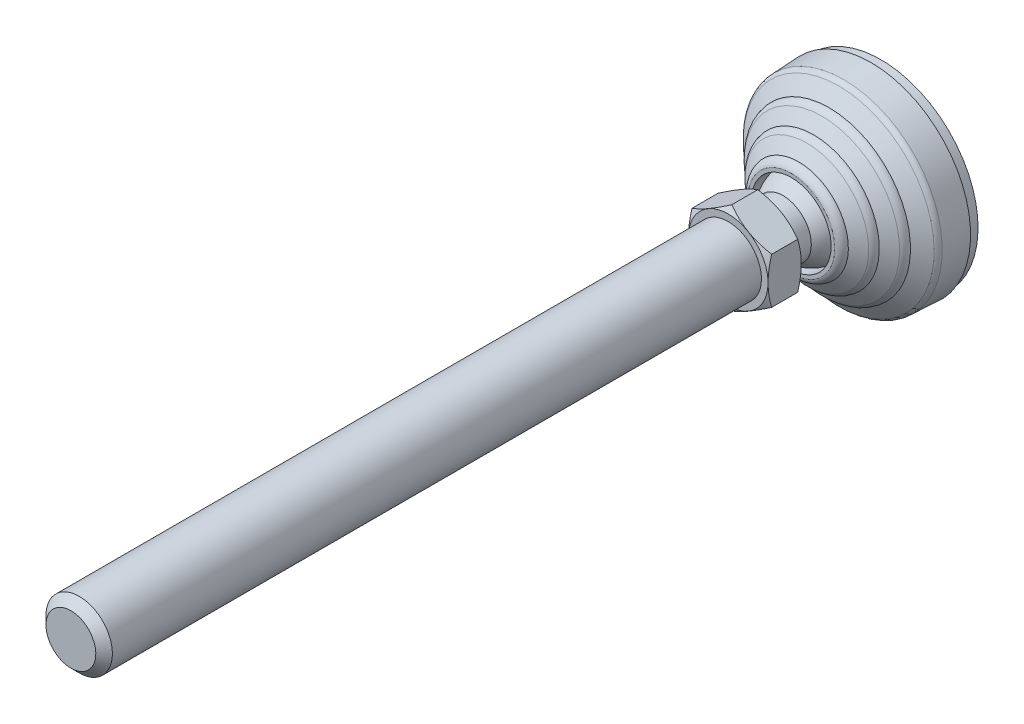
ISO-10303-21;
HEADER;
FILE_DESCRIPTION(('STEP AP214'),'2;1');
FILE_NAME('part.step','',(''),(''),'','','');
FILE_SCHEMA(('AUTOMOTIVE_DESIGN { 1 0 10303 214 1 1 1 1 }'));
ENDSEC;
DATA;
#1=APPLICATION_CONTEXT('core data for automotive mechanical design processes');
#2=APPLICATION_PROTOCOL_DEFINITION('international standard','automotive_design',2000,#1);
#3=PRODUCT_CONTEXT('',#1,'mechanical');
#4=PRODUCT('Part','Part','',(#3));
#5=PRODUCT_RELATED_PRODUCT_CATEGORY('part','',(#4));
#6=PRODUCT_DEFINITION_FORMATION('','',#4);
#7=PRODUCT_DEFINITION_CONTEXT('part definition',#1,'design');
#8=PRODUCT_DEFINITION('design','',#6,#7);
#9=PRODUCT_DEFINITION_SHAPE('','',#8);
#10=(LENGTH_UNIT() NAMED_UNIT(*) SI_UNIT(.MILLI.,.METRE.));
#11=(NAMED_UNIT(*) PLANE_ANGLE_UNIT() SI_UNIT($,.RADIAN.));
#12=(NAMED_UNIT(*) SI_UNIT($,.STERADIAN.) SOLID_ANGLE_UNIT());
#13=UNCERTAINTY_MEASURE_WITH_UNIT(LENGTH_MEASURE(1.E-05),#10,'distance_accuracy_value','');
#14=(GEOMETRIC_REPRESENTATION_CONTEXT(3) GLOBAL_UNCERTAINTY_ASSIGNED_CONTEXT((#13)) GLOBAL_UNIT_ASSIGNED_CONTEXT((#10,
#11,#12)) REPRESENTATION_CONTEXT('',''));
#15=CARTESIAN_POINT('',(0.,0.,0.));
#16=DIRECTION('',(0.,0.,1.));
#17=DIRECTION('',(1.,0.,0.));
#18=AXIS2_PLACEMENT_3D('',#15,#16,#17);
#19=CARTESIAN_POINT('',(0.,0.,93.4665));
#20=DIRECTION('',(0.,0.,-1.));
#21=DIRECTION('',(0.,1.,0.));
#22=AXIS2_PLACEMENT_3D('',#19,#20,#21);
#23=CYLINDRICAL_SURFACE('',#22,10.);
#24=CARTESIAN_POINT('',(0.,0.,241.5));
#25=DIRECTION('',(0.,0.,1.));
#26=DIRECTION('',(0.,-1.,0.));
#27=AXIS2_PLACEMENT_3D('',#24,#25,#26);
#28=CIRCLE('',#27,10.);
#29=CARTESIAN_POINT('',(0.,-10.,241.5));
#30=VERTEX_POINT('',#29);
#31=EDGE_CURVE('E9',#30,#30,#28,.F.);
#32=ORIENTED_EDGE('',*,*,#31,.T.);
#33=EDGE_LOOP('',(#32));
#34=FACE_BOUND('',#33,.T.);
#35=CARTESIAN_POINT('',(0.,0.,46.));
#36=DIRECTION('',(0.,0.,-1.));
#37=DIRECTION('',(0.,1.,0.));
#38=AXIS2_PLACEMENT_3D('',#35,#36,#37);
#39=CIRCLE('',#38,10.);
#40=CARTESIAN_POINT('',(0.,10.,46.));
#41=VERTEX_POINT('',#40);
#42=EDGE_CURVE('E124',#41,#41,#39,.F.);
#43=ORIENTED_EDGE('',*,*,#42,.T.);
#44=EDGE_LOOP('',(#43));
#45=FACE_BOUND('',#44,.T.);
#46=ADVANCED_FACE('F14',(#34,#45),#23,.T.);
#47=CARTESIAN_POINT('',(10.995,0.,46.));
#48=DIRECTION('',(0.,0.,1.));
#49=DIRECTION('',(0.,-1.,0.));
#50=AXIS2_PLACEMENT_3D('',#47,#48,#49);
#51=PLANE('',#50);
#52=CARTESIAN_POINT('',(0.,0.,46.));
#53=DIRECTION('',(0.,0.,-1.));
#54=DIRECTION('',(0.,1.,0.));
#55=AXIS2_PLACEMENT_3D('',#52,#53,#54);
#56=CIRCLE('',#55,11.99);
#57=CARTESIAN_POINT('',(0.,11.99,46.));
#58=VERTEX_POINT('',#57);
#59=EDGE_CURVE('E132',#58,#58,#56,.F.);
#60=ORIENTED_EDGE('',*,*,#59,.T.);
#61=EDGE_LOOP('',(#60));
#62=FACE_BOUND('',#61,.T.);
#63=ORIENTED_EDGE('',*,*,#42,.F.);
#64=EDGE_LOOP('',(#63));
#65=FACE_BOUND('',#64,.T.);
#66=ADVANCED_FACE('F157',(#62,#65),#51,.T.);
#67=CARTESIAN_POINT('',(0.,0.,44.9159643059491));
#68=DIRECTION('',(0.,0.,-1.));
#69=DIRECTION('',(0.,1.,0.));
#70=AXIS2_PLACEMENT_3D('',#67,#68,#69);
#71=CONICAL_SURFACE('',#70,13.8676048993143,1.0471975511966);
#72=ORIENTED_EDGE('',*,*,#59,.F.);
#73=EDGE_LOOP('',(#72));
#74=FACE_BOUND('',#73,.T.);
#75=CARTESIAN_POINT('',(-2.88482840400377E-08,-13.8564064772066,44.9224297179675));
#76=CARTESIAN_POINT('',(0.263784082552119,-13.7041106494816,45.010340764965));
#77=CARTESIAN_POINT('',(0.528551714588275,-13.5512469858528,45.0942615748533));
#78=CARTESIAN_POINT('',(1.06021019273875,-13.2442938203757,45.2530155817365));
#79=CARTESIAN_POINT('',(1.32710170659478,-13.0902039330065,45.3278457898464));
#80=CARTESIAN_POINT('',(2.13207647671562,-12.6254515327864,45.537252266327));
#81=CARTESIAN_POINT('',(2.67333741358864,-12.3129543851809,45.6563603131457));
#82=CARTESIAN_POINT('',(3.48330954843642,-11.8453167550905,45.796023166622));
#83=CARTESIAN_POINT('',(3.74960108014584,-11.6915732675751,45.8358073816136));
#84=CARTESIAN_POINT('',(4.28341699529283,-11.3833745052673,45.9025217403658));
#85=CARTESIAN_POINT('',(4.55094140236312,-11.2289192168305,45.9294516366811));
#86=CARTESIAN_POINT('',(5.08643614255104,-10.9197511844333,45.9697675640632));
#87=CARTESIAN_POINT('',(5.35440556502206,-10.7650389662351,45.9831696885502));
#88=CARTESIAN_POINT('',(5.8905925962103,-10.4554712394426,45.996144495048));
#89=CARTESIAN_POINT('',(6.15881019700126,-10.3006157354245,45.9957176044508));
#90=CARTESIAN_POINT('',(6.66023029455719,-10.0111207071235,45.9820002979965));
#91=CARTESIAN_POINT('',(6.89346857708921,-9.87646052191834,45.97038309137));
#92=CARTESIAN_POINT('',(7.35940867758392,-9.60744987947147,45.9369099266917));
#93=CARTESIAN_POINT('',(7.59211045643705,-9.47309944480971,45.9150532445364));
#94=CARTESIAN_POINT('',(8.05685109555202,-9.20478131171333,45.8614821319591));
#95=CARTESIAN_POINT('',(8.28888924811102,-9.07081402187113,45.8297595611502));
#96=CARTESIAN_POINT('',(8.75187776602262,-8.80350747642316,45.7570131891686));
#97=CARTESIAN_POINT('',(8.98282805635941,-8.67016826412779,45.7159887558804));
#98=CARTESIAN_POINT('',(9.68388987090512,-8.26541003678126,45.5779256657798));
#99=CARTESIAN_POINT('',(10.1519713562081,-7.99516306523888,45.4671213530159));
#100=CARTESIAN_POINT('',(11.081155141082,-7.45869855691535,45.2156417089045));
#101=CARTESIAN_POINT('',(11.5422693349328,-7.19247415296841,45.075025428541));
#102=CARTESIAN_POINT('',(11.9999999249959,-6.92820327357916,44.922429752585));
#103=B_SPLINE_CURVE_WITH_KNOTS('',3,(#75,#76,#77,#78,#79,#80,#81,#82,#83,#84,#85,#86,#87,#88,
#89,#90,#91,#92,#93,#94,#95,#96,#97,#98,#99,#100,#101,#102),.UNSPECIFIED.,.F.,.F.,(4,2,2,2,2,2,
2,2,2,2,2,2,2,4),(0.,0.950996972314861,1.90230578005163,3.80897261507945,4.73890631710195,
5.6688579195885,6.59770188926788,7.52651715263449,8.33503482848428,9.14360968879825,
9.95285348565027,10.7621522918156,12.4163368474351,14.0672749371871),.UNSPECIFIED.);
#104=CARTESIAN_POINT('',(-1.44241383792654E-08,-13.8564064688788,44.9224297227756));
#105=VERTEX_POINT('',#104);
#106=CARTESIAN_POINT('',(12.,-6.92820324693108,44.9224297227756));
#107=VERTEX_POINT('',#106);
#108=EDGE_CURVE('E143',#105,#107,#103,.T.);
#109=ORIENTED_EDGE('',*,*,#108,.T.);
#110=CARTESIAN_POINT('',(12.,-6.92820326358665,44.9224297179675));
#111=CARTESIAN_POINT('',(12.,-6.64374493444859,45.0045333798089));
#112=CARTESIAN_POINT('',(12.,-6.35829458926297,45.0831531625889));
#113=CARTESIAN_POINT('',(12.,-5.78524260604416,45.2325348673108));
#114=CARTESIAN_POINT('',(12.,-5.49764024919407,45.3032940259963));
#115=CARTESIAN_POINT('',(12.,-4.63053083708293,45.5026195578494));
#116=CARTESIAN_POINT('',(12.,-4.04782834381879,45.6179071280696));
#117=CARTESIAN_POINT('',(12.,-3.17548925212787,45.7575170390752));
#118=CARTESIAN_POINT('',(12.,-2.88840964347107,45.7982045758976));
#119=CARTESIAN_POINT('',(12.,-2.31290718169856,45.8685767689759));
#120=CARTESIAN_POINT('',(12.,-2.02448443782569,45.8982623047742));
#121=CARTESIAN_POINT('',(12.,-1.44696804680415,45.9459902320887));
#122=CARTESIAN_POINT('',(12.,-1.15787537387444,45.9640443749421));
#123=CARTESIAN_POINT('',(12.,-0.579188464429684,45.9881624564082));
#124=CARTESIAN_POINT('',(12.,-0.289594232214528,45.994226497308));
#125=CARTESIAN_POINT('',(12.,0.289594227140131,45.9942264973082));
#126=CARTESIAN_POINT('',(12.,0.579188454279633,45.9881624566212));
#127=CARTESIAN_POINT('',(12.,1.15787535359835,45.9640443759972));
#128=CARTESIAN_POINT('',(12.,1.44696802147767,45.9459902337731));
#129=CARTESIAN_POINT('',(12.,2.02448440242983,45.8982623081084));
#130=CARTESIAN_POINT('',(12.,2.31290714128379,45.8685767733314));
#131=CARTESIAN_POINT('',(12.,2.88840959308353,45.798204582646));
#132=CARTESIAN_POINT('',(12.,3.17548919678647,45.7575170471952));
#133=CARTESIAN_POINT('',(12.,4.04782827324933,45.6179071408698));
#134=CARTESIAN_POINT('',(12.,4.63053075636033,45.5026195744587));
#135=CARTESIAN_POINT('',(12.,5.49764015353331,45.3032940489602));
#136=CARTESIAN_POINT('',(12.,5.78524250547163,45.2325348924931));
#137=CARTESIAN_POINT('',(12.,6.35829447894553,45.0831531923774));
#138=CARTESIAN_POINT('',(12.,6.64374481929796,45.004533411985));
#139=CARTESIAN_POINT('',(12.,6.92820314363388,44.9224297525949));
#140=B_SPLINE_CURVE_WITH_KNOTS('',3,(#110,#111,#112,#113,#114,#115,#116,#117,#118,#119,#120,
#121,#122,#123,#124,#125,#126,#127,#128,#129,#130,#131,#132,#133,#134,#135,#136,#137,#138,#139),
.UNSPECIFIED.,.F.,.F.,(4,2,2,2,2,2,2,2,2,2,2,2,2,2,4),(0.,0.888148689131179,1.77660860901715,
3.55698615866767,4.42666281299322,5.2962699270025,6.16499708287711,7.03371682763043,
7.90243655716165,8.7711636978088,9.64077079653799,10.5104474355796,12.2908249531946,
13.1792848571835,14.0674335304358),.UNSPECIFIED.);
#141=CARTESIAN_POINT('',(12.0000000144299,6.92820322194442,44.9224297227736));
#142=VERTEX_POINT('',#141);
#143=EDGE_CURVE('E135',#107,#142,#140,.T.);
#144=ORIENTED_EDGE('',*,*,#143,.T.);
#145=CARTESIAN_POINT('',(12.0000000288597,6.92820321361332,44.9224297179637));
#146=CARTESIAN_POINT('',(11.7362159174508,7.08049904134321,45.0103407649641));
#147=CARTESIAN_POINT('',(11.4714482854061,7.23336270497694,45.0942615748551));
#148=CARTESIAN_POINT('',(10.9397898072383,7.54031587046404,45.2530155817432));
#149=CARTESIAN_POINT('',(10.6728982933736,7.69440575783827,45.3278457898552));
#150=CARTESIAN_POINT('',(9.86792352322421,8.15915815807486,45.5372522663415));
#151=CARTESIAN_POINT('',(9.32666258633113,8.47165530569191,45.6563603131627));
#152=CARTESIAN_POINT('',(8.51669045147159,8.93929293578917,45.7960231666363));
#153=CARTESIAN_POINT('',(8.25039891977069,9.0930364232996,45.8358073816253));
#154=CARTESIAN_POINT('',(7.71658300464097,9.40123518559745,45.9025217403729));
#155=CARTESIAN_POINT('',(7.44905859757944,9.55569047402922,45.9294516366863));
#156=CARTESIAN_POINT('',(6.91356385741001,9.86485850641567,45.9697675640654));
#157=CARTESIAN_POINT('',(6.64559443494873,10.0195707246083,45.9831696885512));
#158=CARTESIAN_POINT('',(6.10940740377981,10.3291384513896,45.996144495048));
#159=CARTESIAN_POINT('',(5.84118980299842,10.4839939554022,45.9957176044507));
#160=CARTESIAN_POINT('',(5.33976970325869,10.773488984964,45.9820002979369));
#161=CARTESIAN_POINT('',(5.10653141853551,10.9081491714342,45.970383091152));
#162=CARTESIAN_POINT('',(4.64059131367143,11.1771598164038,45.9369099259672));
#163=CARTESIAN_POINT('',(4.4078895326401,11.3115102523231,45.9150532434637));
#164=CARTESIAN_POINT('',(3.94314888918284,11.5798283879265,45.8614821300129));
#165=CARTESIAN_POINT('',(3.71111073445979,11.7137956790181,45.8297595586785));
#166=CARTESIAN_POINT('',(3.24812221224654,11.9811022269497,45.7570131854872));
#167=CARTESIAN_POINT('',(3.01717191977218,12.1144414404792,45.7159887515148));
#168=CARTESIAN_POINT('',(2.31611009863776,12.5191996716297,45.5779256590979));
#169=CARTESIAN_POINT('',(1.84802860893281,12.7894466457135,45.4671213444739));
#170=CARTESIAN_POINT('',(0.918844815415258,13.3259111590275,45.2156416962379));
#171=CARTESIAN_POINT('',(0.457730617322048,13.5921355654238,45.0750254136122));
#172=CARTESIAN_POINT('',(2.30778996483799E-08,13.856406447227,44.9224297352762));
#173=B_SPLINE_CURVE_WITH_KNOTS('',3,(#145,#146,#147,#148,#149,#150,#151,#152,#153,#154,#155,
#156,#157,#158,#159,#160,#161,#162,#163,#164,#165,#166,#167,#168,#169,#170,#171,#172),
.UNSPECIFIED.,.F.,.F.,(4,2,2,2,2,2,2,2,2,2,2,2,2,4),(0.,0.95099697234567,1.9023057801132,
3.8089726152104,4.73890631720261,5.66885791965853,6.59770188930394,7.52651715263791,
8.33503483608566,9.14360970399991,9.95285350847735,10.7621523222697,12.4163368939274,
14.0672749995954),.UNSPECIFIED.);
#174=CARTESIAN_POINT('',(-1.15389591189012E-08,13.856406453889,44.92242973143));
#175=VERTEX_POINT('',#174);
#176=EDGE_CURVE('E180',#142,#175,#173,.T.);
#177=ORIENTED_EDGE('',*,*,#176,.T.);
#178=CARTESIAN_POINT('',(-2.30779115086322E-08,13.856406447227,44.9224297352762));
#179=CARTESIAN_POINT('',(-0.263784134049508,13.7041106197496,45.0103407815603));
#180=CARTESIAN_POINT('',(-0.528551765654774,13.5512469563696,45.0942615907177));
#181=CARTESIAN_POINT('',(-1.06021024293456,13.2442937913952,45.2530155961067));
#182=CARTESIAN_POINT('',(-1.32710175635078,13.0902039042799,45.3278458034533));
#183=CARTESIAN_POINT('',(-2.13207652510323,12.6254515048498,45.5372522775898));
#184=CARTESIAN_POINT('',(-2.67333746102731,12.3129543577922,45.656360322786));
#185=CARTESIAN_POINT('',(-3.48330959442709,11.8453167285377,45.7960231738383));
#186=CARTESIAN_POINT('',(-3.74960112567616,11.6915732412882,45.8358073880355));
#187=CARTESIAN_POINT('',(-4.28341703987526,11.3833744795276,45.9025217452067));
#188=CARTESIAN_POINT('',(-4.55094144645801,11.2289191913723,45.9294516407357));
#189=CARTESIAN_POINT('',(-5.08643618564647,10.9197511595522,45.9697675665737));
#190=CARTESIAN_POINT('',(-5.35440560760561,10.7650389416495,45.9831696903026));
#191=CARTESIAN_POINT('',(-5.89059263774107,10.4554712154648,45.9961444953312));
#192=CARTESIAN_POINT('',(-6.15881023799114,10.300615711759,45.9957176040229));
#193=CARTESIAN_POINT('',(-6.66023033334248,10.0111206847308,45.9820002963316));
#194=CARTESIAN_POINT('',(-6.89346861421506,9.87646050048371,45.9703830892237));
#195=CARTESIAN_POINT('',(-7.35940871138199,9.60744985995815,45.9369099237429));
#196=CARTESIAN_POINT('',(-7.59211048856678,9.47309942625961,45.9150532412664));
#197=CARTESIAN_POINT('',(-8.05685112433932,9.20478129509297,45.8614821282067));
#198=CARTESIAN_POINT('',(-8.28888927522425,9.0708140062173,45.8297595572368));
#199=CARTESIAN_POINT('',(-8.75187778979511,8.80350746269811,45.7570131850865));
#200=CARTESIAN_POINT('',(-8.98282807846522,8.67016825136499,45.7159887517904));
#201=CARTESIAN_POINT('',(-9.68388988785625,8.26541002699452,45.5779256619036));
#202=CARTESIAN_POINT('',(-10.1519713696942,7.9951630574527,45.4671213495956));
#203=CARTESIAN_POINT('',(-11.0811551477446,7.45869855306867,45.2156417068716));
#204=CARTESIAN_POINT('',(-11.5422693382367,7.19247415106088,45.0750254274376));
#205=CARTESIAN_POINT('',(-11.9999999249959,6.92820327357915,44.922429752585));
#206=B_SPLINE_CURVE_WITH_KNOTS('',3,(#178,#179,#180,#181,#182,#183,#184,#185,#186,#187,#188,
#189,#190,#191,#192,#193,#194,#195,#196,#197,#198,#199,#200,#201,#202,#203,#204,#205),
.UNSPECIFIED.,.F.,.F.,(4,2,2,2,2,2,2,2,2,2,2,2,2,4),(0.,0.9509969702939,1.90230577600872,
3.80897260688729,4.73890630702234,5.6688579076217,6.5977018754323,7.52651713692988,
8.33503480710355,9.14360966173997,9.95285345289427,10.7621522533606,12.4163367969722,
14.0672748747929),.UNSPECIFIED.);
#207=CARTESIAN_POINT('',(-12.,6.92820324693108,44.9224297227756));
#208=VERTEX_POINT('',#207);
#209=EDGE_CURVE('E172',#175,#208,#206,.T.);
#210=ORIENTED_EDGE('',*,*,#209,.T.);
#211=CARTESIAN_POINT('',(-12.,6.92820326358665,44.9224297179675));
#212=CARTESIAN_POINT('',(-12.,6.64374493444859,45.0045333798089));
#213=CARTESIAN_POINT('',(-12.,6.35829458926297,45.0831531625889));
#214=CARTESIAN_POINT('',(-12.,5.78524260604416,45.2325348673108));
#215=CARTESIAN_POINT('',(-12.,5.49764024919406,45.3032940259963));
#216=CARTESIAN_POINT('',(-12.,4.63053083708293,45.5026195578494));
#217=CARTESIAN_POINT('',(-12.,4.04782834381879,45.6179071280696));
#218=CARTESIAN_POINT('',(-12.,3.17548925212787,45.7575170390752));
#219=CARTESIAN_POINT('',(-12.,2.88840964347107,45.7982045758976));
#220=CARTESIAN_POINT('',(-12.,2.31290718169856,45.8685767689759));
#221=CARTESIAN_POINT('',(-12.,2.02448443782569,45.8982623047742));
#222=CARTESIAN_POINT('',(-12.,1.44696804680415,45.9459902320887));
#223=CARTESIAN_POINT('',(-12.,1.15787537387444,45.9640443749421));
#224=CARTESIAN_POINT('',(-12.,0.579188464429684,45.9881624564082));
#225=CARTESIAN_POINT('',(-12.,0.289594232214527,45.994226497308));
#226=CARTESIAN_POINT('',(-12.,-0.289594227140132,45.9942264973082));
#227=CARTESIAN_POINT('',(-12.,-0.579188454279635,45.9881624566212));
#228=CARTESIAN_POINT('',(-12.,-1.15787535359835,45.9640443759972));
#229=CARTESIAN_POINT('',(-12.,-1.44696802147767,45.9459902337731));
#230=CARTESIAN_POINT('',(-12.,-2.02448440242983,45.8982623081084));
#231=CARTESIAN_POINT('',(-12.,-2.31290714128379,45.8685767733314));
#232=CARTESIAN_POINT('',(-12.,-2.88840959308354,45.798204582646));
#233=CARTESIAN_POINT('',(-12.,-3.17548919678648,45.7575170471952));
#234=CARTESIAN_POINT('',(-12.,-4.04782827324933,45.6179071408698));
#235=CARTESIAN_POINT('',(-12.,-4.63053075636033,45.5026195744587));
#236=CARTESIAN_POINT('',(-12.,-5.49764015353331,45.3032940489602));
#237=CARTESIAN_POINT('',(-12.,-5.78524250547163,45.2325348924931));
#238=CARTESIAN_POINT('',(-12.,-6.35829447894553,45.0831531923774));
#239=CARTESIAN_POINT('',(-12.,-6.64374481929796,45.004533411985));
#240=CARTESIAN_POINT('',(-12.,-6.92820314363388,44.9224297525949));
#241=B_SPLINE_CURVE_WITH_KNOTS('',3,(#211,#212,#213,#214,#215,#216,#217,#218,#219,#220,#221,
#222,#223,#224,#225,#226,#227,#228,#229,#230,#231,#232,#233,#234,#235,#236,#237,#238,#239,#240),
.UNSPECIFIED.,.F.,.F.,(4,2,2,2,2,2,2,2,2,2,2,2,2,2,4),(0.,0.888148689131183,1.77660860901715,
3.55698615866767,4.42666281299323,5.2962699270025,6.16499708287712,7.03371682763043,
7.90243655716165,8.7711636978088,9.640770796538,10.5104474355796,12.2908249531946,
13.1792848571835,14.0674335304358),.UNSPECIFIED.);
#242=CARTESIAN_POINT('',(-12.0000000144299,-6.92820322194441,44.9224297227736));
#243=VERTEX_POINT('',#242);
#244=EDGE_CURVE('E350',#208,#243,#241,.T.);
#245=ORIENTED_EDGE('',*,*,#244,.T.);
#246=CARTESIAN_POINT('',(-12.0000000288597,-6.92820321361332,44.9224297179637));
#247=CARTESIAN_POINT('',(-11.7362159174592,-7.08049904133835,45.0103407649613));
#248=CARTESIAN_POINT('',(-11.471448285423,-7.23336270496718,45.0942615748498));
#249=CARTESIAN_POINT('',(-10.9397898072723,-7.54031587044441,45.2530155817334));
#250=CARTESIAN_POINT('',(-10.6728982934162,-7.69440575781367,45.3278457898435));
#251=CARTESIAN_POINT('',(-9.86792352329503,-8.15915815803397,45.5372522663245));
#252=CARTESIAN_POINT('',(-9.3266625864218,-8.47165530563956,45.6563603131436));
#253=CARTESIAN_POINT('',(-8.5166904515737,-8.93929293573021,45.7960231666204));
#254=CARTESIAN_POINT('',(-8.25039891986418,-9.09303642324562,45.8358073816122));
#255=CARTESIAN_POINT('',(-7.71658300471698,-9.40123518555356,45.9025217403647));
#256=CARTESIAN_POINT('',(-7.44905859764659,-9.55569047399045,45.9294516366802));
#257=CARTESIAN_POINT('',(-6.91356385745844,-9.8648585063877,45.9697675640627));
#258=CARTESIAN_POINT('',(-6.64559443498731,-10.019570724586,45.9831696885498));
#259=CARTESIAN_POINT('',(-6.10940740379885,-10.3291384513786,45.996144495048));
#260=CARTESIAN_POINT('',(-5.84118980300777,-10.4839939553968,45.9957176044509));
#261=CARTESIAN_POINT('',(-5.33976970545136,-10.7734889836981,45.9820002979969));
#262=CARTESIAN_POINT('',(-5.10653142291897,-10.9081491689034,45.9703830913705));
#263=CARTESIAN_POINT('',(-4.64059132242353,-11.1771598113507,45.9369099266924));
#264=CARTESIAN_POINT('',(-4.40788954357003,-11.3115102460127,45.9150532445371));
#265=CARTESIAN_POINT('',(-3.94314890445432,-11.5798283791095,45.8614821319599));
#266=CARTESIAN_POINT('',(-3.71111075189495,-11.7137956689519,45.8297595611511));
#267=CARTESIAN_POINT('',(-3.24812223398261,-11.9811022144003,45.7570131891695));
#268=CARTESIAN_POINT('',(-3.01717194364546,-12.1144414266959,45.7159887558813));
#269=CARTESIAN_POINT('',(-2.3161101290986,-12.5191996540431,45.5779256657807));
#270=CARTESIAN_POINT('',(-1.84802864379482,-12.7894466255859,45.4671213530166));
#271=CARTESIAN_POINT('',(-0.918844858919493,-13.3259111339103,45.215641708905));
#272=CARTESIAN_POINT('',(-0.457730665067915,-13.5921355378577,45.0750254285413));
#273=CARTESIAN_POINT('',(-7.50040961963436E-08,-13.8564064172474,44.922429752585));
#274=B_SPLINE_CURVE_WITH_KNOTS('',3,(#246,#247,#248,#249,#250,#251,#252,#253,#254,#255,#256,
#257,#258,#259,#260,#261,#262,#263,#264,#265,#266,#267,#268,#269,#270,#271,#272,#273),
.UNSPECIFIED.,.F.,.F.,(4,2,2,2,2,2,2,2,2,2,2,2,2,4),(0.,0.950996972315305,1.90230578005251,
3.80897261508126,4.73890631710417,5.66885791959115,6.59770188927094,7.52651715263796,
8.33503482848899,9.14360968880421,9.95285348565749,10.7621522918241,12.4163368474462,
14.0672749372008),.UNSPECIFIED.);
#275=EDGE_CURVE('E162',#243,#105,#274,.T.);
#276=ORIENTED_EDGE('',*,*,#275,.T.);
#277=EDGE_LOOP('',(#109,#144,#177,#210,#245,#276));
#278=FACE_BOUND('',#277,.T.);
#279=ADVANCED_FACE('F152',(#74,#278),#71,.T.);
#280=CARTESIAN_POINT('',(0.,-13.856406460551,46.1));
#281=DIRECTION('',(0.5,0.866025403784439,0.));
#282=DIRECTION('',(-0.866025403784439,0.5,0.));
#283=AXIS2_PLACEMENT_3D('',#280,#281,#282);
#284=PLANE('',#283);
#285=DIRECTION('',(0.,0.,1.));
#286=VECTOR('',#285,1.);
#287=CARTESIAN_POINT('',(0.,-13.856406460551,46.1));
#288=LINE('',#287,#286);
#289=CARTESIAN_POINT('',(0.,-13.856406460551,37.0775702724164));
#290=VERTEX_POINT('',#289);
#291=EDGE_CURVE('E376',#290,#105,#288,.T.);
#292=ORIENTED_EDGE('',*,*,#291,.T.);
#293=ORIENTED_EDGE('',*,*,#275,.F.);
#294=DIRECTION('',(0.,0.,1.));
#295=VECTOR('',#294,1.);
#296=CARTESIAN_POINT('',(-12.,-6.9282032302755,46.1));
#297=LINE('',#296,#295);
#298=CARTESIAN_POINT('',(-12.,-6.9282032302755,37.0775702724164));
#299=VERTEX_POINT('',#298);
#300=EDGE_CURVE('E368',#299,#243,#297,.T.);
#301=ORIENTED_EDGE('',*,*,#300,.F.);
#302=CARTESIAN_POINT('',(0.,-13.856406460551,37.0775702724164));
#303=CARTESIAN_POINT('',(-0.263784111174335,-13.7041106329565,36.9896592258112));
#304=CARTESIAN_POINT('',(-0.528551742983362,-13.5512469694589,36.9057384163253));
#305=CARTESIAN_POINT('',(-1.0602102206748,-13.2442938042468,36.7469844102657));
#306=CARTESIAN_POINT('',(-1.32710173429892,-13.0902039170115,36.6721542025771));
#307=CARTESIAN_POINT('',(-2.13207650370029,-12.6254515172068,36.4627477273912));
#308=CARTESIAN_POINT('',(-2.67333744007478,-12.3129543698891,36.3436396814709));
#309=CARTESIAN_POINT('',(-3.48330957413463,-11.8453167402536,36.2039768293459));
#310=CARTESIAN_POINT('',(-3.74960110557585,-11.6915732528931,36.1641926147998));
#311=CARTESIAN_POINT('',(-4.28341702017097,-11.3833744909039,36.097478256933));
#312=CARTESIAN_POINT('',(-4.55094142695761,-11.2289192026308,36.0705483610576));
#313=CARTESIAN_POINT('',(-5.08643616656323,-10.9197511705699,36.0302324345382));
#314=CARTESIAN_POINT('',(-5.35440558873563,-10.765038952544,36.0168303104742));
#315=CARTESIAN_POINT('',(-5.89059261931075,-10.4554712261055,36.0038555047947));
#316=CARTESIAN_POINT('',(-6.15881021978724,-10.300615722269,36.0042823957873));
#317=CARTESIAN_POINT('',(-6.66023031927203,-10.0111206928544,36.0179997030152));
#318=CARTESIAN_POINT('',(-6.8934686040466,-9.87646050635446,36.029616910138));
#319=CARTESIAN_POINT('',(-7.35940870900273,-9.6074498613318,36.063090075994));
#320=CARTESIAN_POINT('',(-7.59211049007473,-9.47309942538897,36.0849467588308));
#321=CARTESIAN_POINT('',(-8.05685113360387,-9.20478128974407,36.1385178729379));
#322=CARTESIAN_POINT('',(-8.28888928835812,-9.07081399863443,36.1702404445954));
#323=CARTESIAN_POINT('',(-8.75187781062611,-8.8035074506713,36.2429868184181));
#324=CARTESIAN_POINT('',(-8.98282810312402,-8.67016823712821,36.2840112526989));
#325=CARTESIAN_POINT('',(-9.6838899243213,-8.2654100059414,36.4220743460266));
#326=CARTESIAN_POINT('',(-10.1519714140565,-7.99516303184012,36.5328786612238));
#327=CARTESIAN_POINT('',(-11.0811552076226,-7.45869851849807,36.7843583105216));
#328=CARTESIAN_POINT('',(-11.5422694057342,-7.19247411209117,36.924974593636));
#329=CARTESIAN_POINT('',(-12.,-6.9282032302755,37.0775702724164));
#330=B_SPLINE_CURVE_WITH_KNOTS('',3,(#302,#303,#304,#305,#306,#307,#308,#309,#310,#311,#312,
#313,#314,#315,#316,#317,#318,#319,#320,#321,#322,#323,#324,#325,#326,#327,#328,#329),
.UNSPECIFIED.,.F.,.F.,(4,2,2,2,2,2,2,2,2,2,2,2,2,4),(0.,0.950996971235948,1.90230577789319,
3.80897261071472,4.73890631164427,5.66885791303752,6.59770188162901,7.52651714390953,
8.33503482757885,9.14360969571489,9.9528535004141,10.7621523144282,12.4163368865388,
14.0672749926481),.UNSPECIFIED.);
#331=EDGE_CURVE('E370',#290,#299,#330,.T.);
#332=ORIENTED_EDGE('',*,*,#331,.F.);
#333=EDGE_LOOP('',(#292,#293,#301,#332));
#334=FACE_BOUND('',#333,.T.);
#335=ADVANCED_FACE('F156',(#334),#284,.F.);
#336=CARTESIAN_POINT('',(12.,-6.92820323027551,46.1));
#337=DIRECTION('',(-0.5,0.866025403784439,0.));
#338=DIRECTION('',(-0.866025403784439,-0.5,0.));
#339=AXIS2_PLACEMENT_3D('',#336,#337,#338);
#340=PLANE('',#339);
#341=DIRECTION('',(0.,0.,1.));
#342=VECTOR('',#341,1.);
#343=CARTESIAN_POINT('',(12.,-6.92820323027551,46.1));
#344=LINE('',#343,#342);
#345=CARTESIAN_POINT('',(12.,-6.92820323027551,37.0775702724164));
#346=VERTEX_POINT('',#345);
#347=EDGE_CURVE('E31',#346,#107,#344,.T.);
#348=ORIENTED_EDGE('',*,*,#347,.T.);
#349=ORIENTED_EDGE('',*,*,#108,.F.);
#350=ORIENTED_EDGE('',*,*,#291,.F.);
#351=CARTESIAN_POINT('',(12.,-6.92820323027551,37.0775702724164));
#352=CARTESIAN_POINT('',(11.7362158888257,-7.08049905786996,36.9896592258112));
#353=CARTESIAN_POINT('',(11.4714482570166,-7.2333627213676,36.9057384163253));
#354=CARTESIAN_POINT('',(10.9397897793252,-7.5403158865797,36.7469844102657));
#355=CARTESIAN_POINT('',(10.6728982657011,-7.69440577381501,36.6721542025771));
#356=CARTESIAN_POINT('',(9.86792349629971,-8.15915817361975,36.4627477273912));
#357=CARTESIAN_POINT('',(9.32666255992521,-8.4716553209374,36.3436396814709));
#358=CARTESIAN_POINT('',(8.51669042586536,-8.93929295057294,36.2039768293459));
#359=CARTESIAN_POINT('',(8.25039889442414,-9.09303643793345,36.1641926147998));
#360=CARTESIAN_POINT('',(7.71658297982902,-9.40123519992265,36.097478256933));
#361=CARTESIAN_POINT('',(7.44905857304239,-9.55569048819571,36.0705483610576));
#362=CARTESIAN_POINT('',(6.91356383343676,-9.86485852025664,36.0302324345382));
#363=CARTESIAN_POINT('',(6.64559441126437,-10.0195707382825,36.0168303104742));
#364=CARTESIAN_POINT('',(6.10940738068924,-10.329138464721,36.0038555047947));
#365=CARTESIAN_POINT('',(5.84118978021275,-10.4839939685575,36.0042823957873));
#366=CARTESIAN_POINT('',(5.33976968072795,-10.7734889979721,36.0179997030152));
#367=CARTESIAN_POINT('',(5.10653139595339,-10.9081491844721,36.029616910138));
#368=CARTESIAN_POINT('',(4.64059129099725,-11.1771598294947,36.063090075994));
#369=CARTESIAN_POINT('',(4.40788950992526,-11.3115102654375,36.0849467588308));
#370=CARTESIAN_POINT('',(3.94314886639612,-11.5798284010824,36.1385178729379));
#371=CARTESIAN_POINT('',(3.71111071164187,-11.7137956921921,36.1702404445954));
#372=CARTESIAN_POINT('',(3.24812218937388,-11.9811022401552,36.2429868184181));
#373=CARTESIAN_POINT('',(3.01717189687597,-12.1144414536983,36.2840112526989));
#374=CARTESIAN_POINT('',(2.3161100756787,-12.5191996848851,36.4220743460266));
#375=CARTESIAN_POINT('',(1.84802858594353,-12.7894466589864,36.5328786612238));
#376=CARTESIAN_POINT('',(0.918844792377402,-13.3259111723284,36.7843583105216));
#377=CARTESIAN_POINT('',(0.457730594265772,-13.5921355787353,36.924974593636));
#378=CARTESIAN_POINT('',(0.,-13.856406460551,37.0775702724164));
#379=B_SPLINE_CURVE_WITH_KNOTS('',3,(#351,#352,#353,#354,#355,#356,#357,#358,#359,#360,#361,
#362,#363,#364,#365,#366,#367,#368,#369,#370,#371,#372,#373,#374,#375,#376,#377,#378),
.UNSPECIFIED.,.F.,.F.,(4,2,2,2,2,2,2,2,2,2,2,2,2,4),(0.,0.95099697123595,1.90230577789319,
3.80897261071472,4.73890631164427,5.66885791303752,6.59770188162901,7.52651714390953,
8.33503482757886,9.14360969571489,9.9528535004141,10.7621523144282,12.4163368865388,
14.0672749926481),.UNSPECIFIED.);
#380=EDGE_CURVE('E377',#346,#290,#379,.T.);
#381=ORIENTED_EDGE('',*,*,#380,.F.);
#382=EDGE_LOOP('',(#348,#349,#350,#381));
#383=FACE_BOUND('',#382,.T.);
#384=ADVANCED_FACE('F383',(#383),#340,.F.);
#385=CARTESIAN_POINT('',(-12.,6.92820323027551,46.1));
#386=DIRECTION('',(0.5,-0.866025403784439,0.));
#387=DIRECTION('',(0.866025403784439,0.5,0.));
#388=AXIS2_PLACEMENT_3D('',#385,#386,#387);
#389=PLANE('',#388);
#390=DIRECTION('',(0.,0.,1.));
#391=VECTOR('',#390,1.);
#392=CARTESIAN_POINT('',(-12.,6.92820323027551,46.1));
#393=LINE('',#392,#391);
#394=CARTESIAN_POINT('',(-12.,6.92820323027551,37.0775702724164));
#395=VERTEX_POINT('',#394);
#396=EDGE_CURVE('E369',#395,#208,#393,.T.);
#397=ORIENTED_EDGE('',*,*,#396,.T.);
#398=ORIENTED_EDGE('',*,*,#209,.F.);
#399=DIRECTION('',(0.,0.,1.));
#400=VECTOR('',#399,1.);
#401=CARTESIAN_POINT('',(0.,13.856406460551,46.1));
#402=LINE('',#401,#400);
#403=CARTESIAN_POINT('',(0.,13.856406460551,37.0775702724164));
#404=VERTEX_POINT('',#403);
#405=EDGE_CURVE('E211',#404,#175,#402,.T.);
#406=ORIENTED_EDGE('',*,*,#405,.F.);
#407=CARTESIAN_POINT('',(-12.,6.92820323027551,37.0775702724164));
#408=CARTESIAN_POINT('',(-11.7362158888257,7.08049905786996,36.9896592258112));
#409=CARTESIAN_POINT('',(-11.4714482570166,7.2333627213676,36.9057384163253));
#410=CARTESIAN_POINT('',(-10.9397897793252,7.5403158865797,36.7469844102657));
#411=CARTESIAN_POINT('',(-10.6728982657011,7.69440577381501,36.6721542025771));
#412=CARTESIAN_POINT('',(-9.86792349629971,8.15915817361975,36.4627477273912));
#413=CARTESIAN_POINT('',(-9.32666255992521,8.4716553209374,36.3436396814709));
#414=CARTESIAN_POINT('',(-8.51669042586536,8.93929295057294,36.2039768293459));
#415=CARTESIAN_POINT('',(-8.25039889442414,9.09303643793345,36.1641926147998));
#416=CARTESIAN_POINT('',(-7.71658297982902,9.40123519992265,36.097478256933));
#417=CARTESIAN_POINT('',(-7.44905857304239,9.55569048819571,36.0705483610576));
#418=CARTESIAN_POINT('',(-6.91356383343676,9.86485852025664,36.0302324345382));
#419=CARTESIAN_POINT('',(-6.64559441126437,10.0195707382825,36.0168303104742));
#420=CARTESIAN_POINT('',(-6.10940738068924,10.329138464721,36.0038555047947));
#421=CARTESIAN_POINT('',(-5.84118978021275,10.4839939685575,36.0042823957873));
#422=CARTESIAN_POINT('',(-5.33976968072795,10.7734889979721,36.0179997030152));
#423=CARTESIAN_POINT('',(-5.10653139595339,10.9081491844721,36.029616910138));
#424=CARTESIAN_POINT('',(-4.64059129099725,11.1771598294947,36.063090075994));
#425=CARTESIAN_POINT('',(-4.40788950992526,11.3115102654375,36.0849467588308));
#426=CARTESIAN_POINT('',(-3.94314886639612,11.5798284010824,36.1385178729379));
#427=CARTESIAN_POINT('',(-3.71111071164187,11.7137956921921,36.1702404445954));
#428=CARTESIAN_POINT('',(-3.24812218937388,11.9811022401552,36.2429868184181));
#429=CARTESIAN_POINT('',(-3.01717189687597,12.1144414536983,36.2840112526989));
#430=CARTESIAN_POINT('',(-2.3161100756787,12.5191996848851,36.4220743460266));
#431=CARTESIAN_POINT('',(-1.84802858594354,12.7894466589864,36.5328786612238));
#432=CARTESIAN_POINT('',(-0.918844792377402,13.3259111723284,36.7843583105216));
#433=CARTESIAN_POINT('',(-0.457730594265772,13.5921355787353,36.924974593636));
#434=CARTESIAN_POINT('',(0.,13.856406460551,37.0775702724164));
#435=B_SPLINE_CURVE_WITH_KNOTS('',3,(#407,#408,#409,#410,#411,#412,#413,#414,#415,#416,#417,
#418,#419,#420,#421,#422,#423,#424,#425,#426,#427,#428,#429,#430,#431,#432,#433,#434),
.UNSPECIFIED.,.F.,.F.,(4,2,2,2,2,2,2,2,2,2,2,2,2,4),(0.,0.95099697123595,1.90230577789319,
3.80897261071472,4.73890631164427,5.66885791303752,6.59770188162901,7.52651714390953,
8.33503482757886,9.14360969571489,9.9528535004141,10.7621523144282,12.4163368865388,
14.0672749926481),.UNSPECIFIED.);
#436=EDGE_CURVE('E213',#395,#404,#435,.T.);
#437=ORIENTED_EDGE('',*,*,#436,.F.);
#438=EDGE_LOOP('',(#397,#398,#406,#437));
#439=FACE_BOUND('',#438,.T.);
#440=ADVANCED_FACE('F199',(#439),#389,.F.);
#441=CARTESIAN_POINT('',(-12.,-6.92820323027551,46.1));
#442=DIRECTION('',(1.,0.,0.));
#443=DIRECTION('',(0.,1.,0.));
#444=AXIS2_PLACEMENT_3D('',#441,#442,#443);
#445=PLANE('',#444);
#446=ORIENTED_EDGE('',*,*,#300,.T.);
#447=ORIENTED_EDGE('',*,*,#244,.F.);
#448=ORIENTED_EDGE('',*,*,#396,.F.);
#449=CARTESIAN_POINT('',(-12.,-6.9282032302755,37.0775702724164));
#450=CARTESIAN_POINT('',(-12.,-6.64374490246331,36.9954666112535));
#451=CARTESIAN_POINT('',(-12.,-6.35829455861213,36.9168468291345));
#452=CARTESIAN_POINT('',(-12.,-5.78524257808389,36.7674651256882));
#453=CARTESIAN_POINT('',(-12.,-5.49764022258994,36.6967059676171));
#454=CARTESIAN_POINT('',(-12.,-4.63053081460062,36.4973804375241));
#455=CARTESIAN_POINT('',(-12.,-4.04782832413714,36.3820928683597));
#456=CARTESIAN_POINT('',(-12.,-3.17548923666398,36.2424829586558));
#457=CARTESIAN_POINT('',(-12.,-2.88840962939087,36.2017954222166));
#458=CARTESIAN_POINT('',(-12.,-2.31290717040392,36.1314232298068));
#459=CARTESIAN_POINT('',(-12.,-2.02448442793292,36.1017376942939));
#460=CARTESIAN_POINT('',(-12.,-1.44696803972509,36.0540097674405));
#461=CARTESIAN_POINT('',(-12.,-1.1578753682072,36.035955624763));
#462=CARTESIAN_POINT('',(-12.,-0.579188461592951,36.0118375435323));
#463=CARTESIAN_POINT('',(-12.,-0.289594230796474,36.0057735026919));
#464=CARTESIAN_POINT('',(-12.,0.28959423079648,36.0057735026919));
#465=CARTESIAN_POINT('',(-12.,0.579188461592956,36.0118375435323));
#466=CARTESIAN_POINT('',(-12.,1.15787536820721,36.035955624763));
#467=CARTESIAN_POINT('',(-12.,1.4469680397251,36.0540097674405));
#468=CARTESIAN_POINT('',(-12.,2.02448442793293,36.1017376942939));
#469=CARTESIAN_POINT('',(-12.,2.31290717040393,36.1314232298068));
#470=CARTESIAN_POINT('',(-12.,2.88840962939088,36.2017954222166));
#471=CARTESIAN_POINT('',(-12.,3.17548923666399,36.2424829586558));
#472=CARTESIAN_POINT('',(-12.,4.04782832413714,36.3820928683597));
#473=CARTESIAN_POINT('',(-12.,4.63053081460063,36.4973804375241));
#474=CARTESIAN_POINT('',(-12.,5.49764022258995,36.6967059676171));
#475=CARTESIAN_POINT('',(-12.,5.7852425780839,36.7674651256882));
#476=CARTESIAN_POINT('',(-12.,6.35829455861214,36.9168468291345));
#477=CARTESIAN_POINT('',(-12.,6.64374490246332,36.9954666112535));
#478=CARTESIAN_POINT('',(-12.,6.92820323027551,37.0775702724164));
#479=B_SPLINE_CURVE_WITH_KNOTS('',3,(#449,#450,#451,#452,#453,#454,#455,#456,#457,#458,#459,
#460,#461,#462,#463,#464,#465,#466,#467,#468,#469,#470,#471,#472,#473,#474,#475,#476,#477,#478),
.UNSPECIFIED.,.F.,.F.,(4,2,2,2,2,2,2,2,2,2,2,2,2,2,4),(0.,0.888148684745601,1.77660860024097,
3.55698614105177,4.42666279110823,5.29626990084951,6.16499705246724,7.03371679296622,
7.90243653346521,8.77116368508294,9.64077079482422,10.5104474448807,12.2908249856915,
13.1792849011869,14.0674335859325),.UNSPECIFIED.);
#480=EDGE_CURVE('E362',#299,#395,#479,.T.);
#481=ORIENTED_EDGE('',*,*,#480,.F.);
#482=EDGE_LOOP('',(#446,#447,#448,#481));
#483=FACE_BOUND('',#482,.T.);
#484=ADVANCED_FACE('F356',(#483),#445,.F.);
#485=CARTESIAN_POINT('',(12.,6.92820323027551,46.1));
#486=DIRECTION('',(-1.,0.,0.));
#487=DIRECTION('',(0.,-1.,0.));
#488=AXIS2_PLACEMENT_3D('',#485,#486,#487);
#489=PLANE('',#488);
#490=DIRECTION('',(0.,0.,1.));
#491=VECTOR('',#490,1.);
#492=CARTESIAN_POINT('',(12.,6.92820323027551,46.1));
#493=LINE('',#492,#491);
#494=CARTESIAN_POINT('',(12.,6.9282032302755,37.0775702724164));
#495=VERTEX_POINT('',#494);
#496=EDGE_CURVE('E410',#142,#495,#493,.F.);
#497=ORIENTED_EDGE('',*,*,#496,.F.);
#498=ORIENTED_EDGE('',*,*,#143,.F.);
#499=ORIENTED_EDGE('',*,*,#347,.F.);
#500=CARTESIAN_POINT('',(12.,6.92820323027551,37.0775702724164));
#501=CARTESIAN_POINT('',(12.,6.64374490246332,36.9954666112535));
#502=CARTESIAN_POINT('',(12.,6.35829455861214,36.9168468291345));
#503=CARTESIAN_POINT('',(12.,5.7852425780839,36.7674651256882));
#504=CARTESIAN_POINT('',(12.,5.49764022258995,36.6967059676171));
#505=CARTESIAN_POINT('',(12.,4.63053081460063,36.4973804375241));
#506=CARTESIAN_POINT('',(12.,4.04782832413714,36.3820928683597));
#507=CARTESIAN_POINT('',(12.,3.17548923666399,36.2424829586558));
#508=CARTESIAN_POINT('',(12.,2.88840962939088,36.2017954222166));
#509=CARTESIAN_POINT('',(12.,2.31290717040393,36.1314232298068));
#510=CARTESIAN_POINT('',(12.,2.02448442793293,36.1017376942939));
#511=CARTESIAN_POINT('',(12.,1.4469680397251,36.0540097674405));
#512=CARTESIAN_POINT('',(12.,1.1578753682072,36.035955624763));
#513=CARTESIAN_POINT('',(12.,0.579188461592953,36.0118375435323));
#514=CARTESIAN_POINT('',(12.,0.289594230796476,36.0057735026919));
#515=CARTESIAN_POINT('',(12.,-0.289594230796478,36.0057735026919));
#516=CARTESIAN_POINT('',(12.,-0.579188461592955,36.0118375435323));
#517=CARTESIAN_POINT('',(12.,-1.15787536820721,36.035955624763));
#518=CARTESIAN_POINT('',(12.,-1.4469680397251,36.0540097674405));
#519=CARTESIAN_POINT('',(12.,-2.02448442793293,36.1017376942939));
#520=CARTESIAN_POINT('',(12.,-2.31290717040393,36.1314232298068));
#521=CARTESIAN_POINT('',(12.,-2.88840962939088,36.2017954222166));
#522=CARTESIAN_POINT('',(12.,-3.17548923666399,36.2424829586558));
#523=CARTESIAN_POINT('',(12.,-4.04782832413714,36.3820928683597));
#524=CARTESIAN_POINT('',(12.,-4.63053081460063,36.4973804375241));
#525=CARTESIAN_POINT('',(12.,-5.49764022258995,36.6967059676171));
#526=CARTESIAN_POINT('',(12.,-5.7852425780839,36.7674651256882));
#527=CARTESIAN_POINT('',(12.,-6.35829455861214,36.9168468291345));
#528=CARTESIAN_POINT('',(12.,-6.64374490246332,36.9954666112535));
#529=CARTESIAN_POINT('',(12.,-6.92820323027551,37.0775702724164));
#530=B_SPLINE_CURVE_WITH_KNOTS('',3,(#500,#501,#502,#503,#504,#505,#506,#507,#508,#509,#510,
#511,#512,#513,#514,#515,#516,#517,#518,#519,#520,#521,#522,#523,#524,#525,#526,#527,#528,#529),
.UNSPECIFIED.,.F.,.F.,(4,2,2,2,2,2,2,2,2,2,2,2,2,2,4),(0.,0.888148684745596,1.77660860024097,
3.55698614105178,4.42666279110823,5.29626990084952,6.16499705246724,7.03371679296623,
7.90243653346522,8.77116368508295,9.64077079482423,10.5104474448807,12.2908249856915,
13.1792849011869,14.0674335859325),.UNSPECIFIED.);
#531=EDGE_CURVE('E188',#495,#346,#530,.T.);
#532=ORIENTED_EDGE('',*,*,#531,.F.);
#533=EDGE_LOOP('',(#497,#498,#499,#532));
#534=FACE_BOUND('',#533,.T.);
#535=ADVANCED_FACE('F150',(#534),#489,.F.);
#536=CARTESIAN_POINT('',(0.,13.856406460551,46.1));
#537=DIRECTION('',(-0.5,-0.866025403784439,0.));
#538=DIRECTION('',(0.866025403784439,-0.5,0.));
#539=AXIS2_PLACEMENT_3D('',#536,#537,#538);
#540=PLANE('',#539);
#541=ORIENTED_EDGE('',*,*,#405,.T.);
#542=ORIENTED_EDGE('',*,*,#176,.F.);
#543=ORIENTED_EDGE('',*,*,#496,.T.);
#544=CARTESIAN_POINT('',(0.,13.856406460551,37.0775702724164));
#545=CARTESIAN_POINT('',(0.263784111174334,13.7041106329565,36.9896592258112));
#546=CARTESIAN_POINT('',(0.528551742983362,13.5512469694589,36.9057384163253));
#547=CARTESIAN_POINT('',(1.0602102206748,13.2442938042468,36.7469844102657));
#548=CARTESIAN_POINT('',(1.32710173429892,13.0902039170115,36.6721542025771));
#549=CARTESIAN_POINT('',(2.13207650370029,12.6254515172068,36.4627477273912));
#550=CARTESIAN_POINT('',(2.67333744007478,12.3129543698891,36.3436396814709));
#551=CARTESIAN_POINT('',(3.48330957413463,11.8453167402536,36.2039768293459));
#552=CARTESIAN_POINT('',(3.74960110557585,11.6915732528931,36.1641926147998));
#553=CARTESIAN_POINT('',(4.28341702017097,11.3833744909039,36.097478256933));
#554=CARTESIAN_POINT('',(4.55094142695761,11.2289192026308,36.0705483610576));
#555=CARTESIAN_POINT('',(5.08643616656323,10.9197511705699,36.0302324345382));
#556=CARTESIAN_POINT('',(5.35440558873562,10.765038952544,36.0168303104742));
#557=CARTESIAN_POINT('',(5.89059261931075,10.4554712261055,36.0038555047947));
#558=CARTESIAN_POINT('',(6.15881021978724,10.300615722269,36.0042823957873));
#559=CARTESIAN_POINT('',(6.66023031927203,10.0111206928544,36.0179997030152));
#560=CARTESIAN_POINT('',(6.8934686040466,9.87646050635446,36.029616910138));
#561=CARTESIAN_POINT('',(7.35940870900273,9.6074498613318,36.063090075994));
#562=CARTESIAN_POINT('',(7.59211049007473,9.47309942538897,36.0849467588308));
#563=CARTESIAN_POINT('',(8.05685113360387,9.20478128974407,36.1385178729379));
#564=CARTESIAN_POINT('',(8.28888928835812,9.07081399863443,36.1702404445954));
#565=CARTESIAN_POINT('',(8.75187781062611,8.8035074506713,36.2429868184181));
#566=CARTESIAN_POINT('',(8.98282810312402,8.67016823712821,36.2840112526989));
#567=CARTESIAN_POINT('',(9.6838899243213,8.2654100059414,36.4220743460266));
#568=CARTESIAN_POINT('',(10.1519714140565,7.99516303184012,36.5328786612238));
#569=CARTESIAN_POINT('',(11.0811552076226,7.45869851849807,36.7843583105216));
#570=CARTESIAN_POINT('',(11.5422694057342,7.19247411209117,36.924974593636));
#571=CARTESIAN_POINT('',(12.,6.9282032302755,37.0775702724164));
#572=B_SPLINE_CURVE_WITH_KNOTS('',3,(#544,#545,#546,#547,#548,#549,#550,#551,#552,#553,#554,
#555,#556,#557,#558,#559,#560,#561,#562,#563,#564,#565,#566,#567,#568,#569,#570,#571),
.UNSPECIFIED.,.F.,.F.,(4,2,2,2,2,2,2,2,2,2,2,2,2,4),(0.,0.950996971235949,1.90230577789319,
3.80897261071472,4.73890631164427,5.66885791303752,6.59770188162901,7.52651714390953,
8.33503482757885,9.14360969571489,9.9528535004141,10.7621523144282,12.4163368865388,
14.0672749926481),.UNSPECIFIED.);
#573=EDGE_CURVE('E68',#404,#495,#572,.T.);
#574=ORIENTED_EDGE('',*,*,#573,.F.);
#575=EDGE_LOOP('',(#541,#542,#543,#574));
#576=FACE_BOUND('',#575,.T.);
#577=ADVANCED_FACE('F195',(#576),#540,.F.);
#578=CARTESIAN_POINT('',(0.,0.,37.0840356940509));
#579=DIRECTION('',(0.,0.,1.));
#580=DIRECTION('',(0.,-1.,0.));
#581=AXIS2_PLACEMENT_3D('',#578,#579,#580);
#582=CONICAL_SURFACE('',#581,13.8676048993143,1.0471975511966);
#583=CARTESIAN_POINT('',(0.,0.,36.));
#584=DIRECTION('',(0.,0.,1.));
#585=DIRECTION('',(0.,-1.,0.));
#586=AXIS2_PLACEMENT_3D('',#583,#584,#585);
#587=CIRCLE('',#586,11.99);
#588=CARTESIAN_POINT('',(0.,-11.99,36.));
#589=VERTEX_POINT('',#588);
#590=EDGE_CURVE('E212',#589,#589,#587,.T.);
#591=ORIENTED_EDGE('',*,*,#590,.T.);
#592=EDGE_LOOP('',(#591));
#593=FACE_BOUND('',#592,.T.);
#594=ORIENTED_EDGE('',*,*,#573,.T.);
#595=ORIENTED_EDGE('',*,*,#531,.T.);
#596=ORIENTED_EDGE('',*,*,#380,.T.);
#597=ORIENTED_EDGE('',*,*,#331,.T.);
#598=ORIENTED_EDGE('',*,*,#480,.T.);
#599=ORIENTED_EDGE('',*,*,#436,.T.);
#600=EDGE_LOOP('',(#594,#595,#596,#597,#598,#599));
#601=FACE_BOUND('',#600,.T.);
#602=ADVANCED_FACE('F198',(#593,#601),#582,.T.);
#603=CARTESIAN_POINT('',(10.245,0.,36.));
#604=DIRECTION('',(0.,0.,-1.));
#605=DIRECTION('',(0.,1.,0.));
#606=AXIS2_PLACEMENT_3D('',#603,#604,#605);
#607=PLANE('',#606);
#608=CARTESIAN_POINT('',(0.,0.,36.));
#609=DIRECTION('',(0.,0.,-1.));
#610=DIRECTION('',(0.,1.,0.));
#611=AXIS2_PLACEMENT_3D('',#608,#609,#610);
#612=CIRCLE('',#611,8.5);
#613=CARTESIAN_POINT('',(0.,8.5,36.));
#614=VERTEX_POINT('',#613);
#615=EDGE_CURVE('E221',#614,#614,#612,.F.);
#616=ORIENTED_EDGE('',*,*,#615,.T.);
#617=EDGE_LOOP('',(#616));
#618=FACE_BOUND('',#617,.T.);
#619=ORIENTED_EDGE('',*,*,#590,.F.);
#620=EDGE_LOOP('',(#619));
#621=FACE_BOUND('',#620,.T.);
#622=ADVANCED_FACE('F437',(#618,#621),#607,.T.);
#623=CARTESIAN_POINT('',(0.,0.,32.7352685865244));
#624=DIRECTION('',(0.,0.,-1.));
#625=DIRECTION('',(0.,1.,0.));
#626=AXIS2_PLACEMENT_3D('',#623,#624,#625);
#627=CYLINDRICAL_SURFACE('',#626,8.5);
#628=ORIENTED_EDGE('',*,*,#615,.F.);
#629=EDGE_LOOP('',(#628));
#630=FACE_BOUND('',#629,.T.);
#631=CARTESIAN_POINT('',(0.,0.,29.4705371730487));
#632=DIRECTION('',(0.,0.,-1.));
#633=DIRECTION('',(0.,1.,0.));
#634=AXIS2_PLACEMENT_3D('',#631,#632,#633);
#635=CIRCLE('',#634,8.5);
#636=CARTESIAN_POINT('',(0.,8.5,29.4705371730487));
#637=VERTEX_POINT('',#636);
#638=EDGE_CURVE('E97',#637,#637,#635,.F.);
#639=ORIENTED_EDGE('',*,*,#638,.T.);
#640=EDGE_LOOP('',(#639));
#641=FACE_BOUND('',#640,.T.);
#642=ADVANCED_FACE('F117',(#630,#641),#627,.T.);
#643=CARTESIAN_POINT('',(0.,0.,21.));
#644=DIRECTION('',(1.,0.,0.));
#645=DIRECTION('',(0.,0.,1.));
#646=AXIS2_PLACEMENT_3D('',#643,#644,#645);
#647=SPHERICAL_SURFACE('',#646,12.);
#648=CARTESIAN_POINT('',(0.,0.,21.));
#649=DIRECTION('',(0.,0.,1.));
#650=DIRECTION('',(1.,0.,0.));
#651=AXIS2_PLACEMENT_3D('',#648,#649,#650);
#652=CIRCLE('',#651,12.);
#653=CARTESIAN_POINT('',(0.,12.,21.));
#654=VERTEX_POINT('',#653);
#655=CARTESIAN_POINT('',(-12.,0.,21.));
#656=VERTEX_POINT('',#655);
#657=EDGE_CURVE('E77',#654,#656,#652,.T.);
#658=ORIENTED_EDGE('',*,*,#657,.T.);
#659=CARTESIAN_POINT('',(-12.,0.,21.));
#660=CARTESIAN_POINT('',(-12.0000041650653,-0.196349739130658,21.));
#661=CARTESIAN_POINT('',(-11.9951810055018,-0.392699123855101,21.));
#662=CARTESIAN_POINT('',(-11.9759099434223,-0.784925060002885,21.));
#663=CARTESIAN_POINT('',(-11.9614620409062,-0.980801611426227,21.));
#664=CARTESIAN_POINT('',(-11.9229713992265,-1.37160975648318,21.));
#665=CARTESIAN_POINT('',(-11.8989286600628,-1.5665413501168,21.));
#666=CARTESIAN_POINT('',(-11.841307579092,-1.95499003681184,21.));
#667=CARTESIAN_POINT('',(-11.8077292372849,-2.14850712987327,21.));
#668=CARTESIAN_POINT('',(-11.7311174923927,-2.53366059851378,21.));
#669=CARTESIAN_POINT('',(-11.6880840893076,-2.72529697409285,21.));
#670=CARTESIAN_POINT('',(-11.5926659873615,-3.10622734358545,21.));
#671=CARTESIAN_POINT('',(-11.5402812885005,-3.29552133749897,21.));
#672=CARTESIAN_POINT('',(-11.4262867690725,-3.67131091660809,21.));
#673=CARTESIAN_POINT('',(-11.3646769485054,-3.85780650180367,21.));
#674=CARTESIAN_POINT('',(-11.2323806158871,-4.22754997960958,21.));
#675=CARTESIAN_POINT('',(-11.1616941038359,-4.41079787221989,21.));
#676=CARTESIAN_POINT('',(-11.011414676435,-4.77360450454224,21.));
#677=CARTESIAN_POINT('',(-10.9318217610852,-4.95316324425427,21.));
#678=CARTESIAN_POINT('',(-10.7639212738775,-5.30815899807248,21.));
#679=CARTESIAN_POINT('',(-10.6756137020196,-5.48359601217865,21.));
#680=CARTESIAN_POINT('',(-10.4904966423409,-5.82992567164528,21.));
#681=CARTESIAN_POINT('',(-10.3936871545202,-6.00081831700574,21.));
#682=CARTESIAN_POINT('',(-10.1917994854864,-6.33764754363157,21.));
#683=CARTESIAN_POINT('',(-10.0867213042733,-6.50358412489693,20.9999999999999));
#684=CARTESIAN_POINT('',(-9.8685493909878,-6.83010146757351,20.9999999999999));
#685=CARTESIAN_POINT('',(-9.75545565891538,-6.99068222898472,20.9999999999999));
#686=CARTESIAN_POINT('',(-9.5215250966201,-7.30610107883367,20.9999999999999));
#687=CARTESIAN_POINT('',(-9.40068826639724,-7.4609391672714,20.9999999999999));
#688=CARTESIAN_POINT('',(-9.15156261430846,-7.76449965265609,20.9999999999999));
#689=CARTESIAN_POINT('',(-9.02327379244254,-7.91322204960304,20.9999999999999));
#690=CARTESIAN_POINT('',(-8.75955321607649,-8.20419286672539,20.9999999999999));
#691=CARTESIAN_POINT('',(-8.62412146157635,-8.3464412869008,20.9999999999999));
#692=CARTESIAN_POINT('',(-8.3464412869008,-8.62412146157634,20.9999999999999));
#693=CARTESIAN_POINT('',(-8.2041928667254,-8.75955321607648,20.9999999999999));
#694=CARTESIAN_POINT('',(-7.91322204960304,-9.02327379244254,20.9999999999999));
#695=CARTESIAN_POINT('',(-7.76449965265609,-9.15156261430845,20.9999999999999));
#696=CARTESIAN_POINT('',(-7.4609391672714,-9.40068826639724,20.9999999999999));
#697=CARTESIAN_POINT('',(-7.30610107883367,-9.5215250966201,20.9999999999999));
#698=CARTESIAN_POINT('',(-6.99068222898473,-9.75545565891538,20.9999999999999));
#699=CARTESIAN_POINT('',(-6.83010146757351,-9.8685493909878,20.9999999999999));
#700=CARTESIAN_POINT('',(-6.50358412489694,-10.0867213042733,20.9999999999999));
#701=CARTESIAN_POINT('',(-6.33764754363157,-10.1917994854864,20.9999999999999));
#702=CARTESIAN_POINT('',(-6.00081831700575,-10.3936871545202,20.9999999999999));
#703=CARTESIAN_POINT('',(-5.82992567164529,-10.4904966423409,20.9999999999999));
#704=CARTESIAN_POINT('',(-5.48359601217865,-10.6756137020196,20.9999999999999));
#705=CARTESIAN_POINT('',(-5.30815899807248,-10.7639212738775,20.9999999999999));
#706=CARTESIAN_POINT('',(-4.95316324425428,-10.9318217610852,20.9999999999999));
#707=CARTESIAN_POINT('',(-4.77360450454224,-11.011414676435,20.9999999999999));
#708=CARTESIAN_POINT('',(-4.4107978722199,-11.1616941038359,20.9999999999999));
#709=CARTESIAN_POINT('',(-4.22754997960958,-11.2323806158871,20.9999999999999));
#710=CARTESIAN_POINT('',(-3.85780650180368,-11.3646769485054,20.9999999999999));
#711=CARTESIAN_POINT('',(-3.6713109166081,-11.4262867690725,20.9999999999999));
#712=CARTESIAN_POINT('',(-3.29552133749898,-11.5402812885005,20.9999999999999));
#713=CARTESIAN_POINT('',(-3.10622734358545,-11.5926659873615,20.9999999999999));
#714=CARTESIAN_POINT('',(-2.72529697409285,-11.6880840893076,20.9999999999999));
#715=CARTESIAN_POINT('',(-2.53366059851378,-11.7311174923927,20.9999999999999));
#716=CARTESIAN_POINT('',(-2.14850712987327,-11.8077292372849,20.9999999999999));
#717=CARTESIAN_POINT('',(-1.95499003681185,-11.841307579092,20.9999999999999));
#718=CARTESIAN_POINT('',(-1.5665413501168,-11.8989286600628,20.9999999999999));
#719=CARTESIAN_POINT('',(-1.37160975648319,-11.9229713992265,20.9999999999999));
#720=CARTESIAN_POINT('',(-0.980801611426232,-11.9614620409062,20.9999999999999));
#721=CARTESIAN_POINT('',(-0.78492506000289,-11.9759099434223,20.9999999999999));
#722=CARTESIAN_POINT('',(-0.392699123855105,-11.9951810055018,20.9999999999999));
#723=CARTESIAN_POINT('',(-0.196349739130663,-12.0000041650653,20.9999999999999));
#724=CARTESIAN_POINT('',(0.,-12.,20.9999999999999));
#725=B_SPLINE_CURVE_WITH_KNOTS('',3,(#659,#660,#661,#662,#663,#664,#665,#666,#667,#668,#669,
#670,#671,#672,#673,#674,#675,#676,#677,#678,#679,#680,#681,#682,#683,#684,#685,#686,#687,#688,
#689,#690,#691,#692,#693,#694,#695,#696,#697,#698,#699,#700,#701,#702,#703,#704,#705,#706,#707,
#708,#709,#710,#711,#712,#713,#714,#715,#716,#717,#718,#719,#720,#721,#722,#723,#724),
.UNSPECIFIED.,.F.,.F.,(4,2,2,2,2,2,2,2,2,2,2,2,2,2,2,2,2,2,2,2,2,2,2,2,2,2,2,2,2,2,2,2,4),(0.,
0.588989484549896,1.17797896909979,1.76696845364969,2.35595793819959,2.94494742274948,
3.53393690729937,4.12292639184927,4.71191587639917,5.30090536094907,5.88989484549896,
6.47888433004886,7.06787381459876,7.65686329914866,8.24585278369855,8.83484226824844,
9.42383175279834,10.0128212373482,10.6018107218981,11.190800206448,11.7797896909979,
12.3687791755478,12.9577686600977,13.5467581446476,14.1357476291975,14.7247371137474,
15.3137265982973,15.9027160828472,16.4917055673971,17.080695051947,17.6696845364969,
18.2586740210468,18.8476635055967),.UNSPECIFIED.);
#726=CARTESIAN_POINT('',(0.,-12.,21.));
#727=VERTEX_POINT('',#726);
#728=EDGE_CURVE('E88',#656,#727,#725,.T.);
#729=ORIENTED_EDGE('',*,*,#728,.T.);
#730=CARTESIAN_POINT('',(0.,0.,21.));
#731=DIRECTION('',(0.,0.,-1.));
#732=DIRECTION('',(1.,0.,0.));
#733=AXIS2_PLACEMENT_3D('',#730,#731,#732);
#734=CIRCLE('',#733,12.);
#735=CARTESIAN_POINT('',(12.,0.,21.));
#736=VERTEX_POINT('',#735);
#737=EDGE_CURVE('E83',#727,#736,#734,.F.);
#738=ORIENTED_EDGE('',*,*,#737,.T.);
#739=CARTESIAN_POINT('',(12.,0.,21.));
#740=CARTESIAN_POINT('',(12.0000041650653,0.196349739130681,21.));
#741=CARTESIAN_POINT('',(11.9951810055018,0.392699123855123,21.));
#742=CARTESIAN_POINT('',(11.9759099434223,0.784925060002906,21.));
#743=CARTESIAN_POINT('',(11.9614620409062,0.980801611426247,21.));
#744=CARTESIAN_POINT('',(11.9229713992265,1.3716097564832,21.));
#745=CARTESIAN_POINT('',(11.8989286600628,1.56654135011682,21.));
#746=CARTESIAN_POINT('',(11.841307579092,1.95499003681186,21.));
#747=CARTESIAN_POINT('',(11.8077292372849,2.14850712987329,21.));
#748=CARTESIAN_POINT('',(11.7311174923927,2.53366059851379,21.));
#749=CARTESIAN_POINT('',(11.6880840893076,2.72529697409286,21.));
#750=CARTESIAN_POINT('',(11.5926659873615,3.10622734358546,21.));
#751=CARTESIAN_POINT('',(11.5402812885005,3.29552133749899,21.));
#752=CARTESIAN_POINT('',(11.4262867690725,3.6713109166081,21.));
#753=CARTESIAN_POINT('',(11.3646769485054,3.85780650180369,21.));
#754=CARTESIAN_POINT('',(11.2323806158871,4.22754997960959,21.));
#755=CARTESIAN_POINT('',(11.1616941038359,4.4107978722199,21.));
#756=CARTESIAN_POINT('',(11.011414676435,4.77360450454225,21.));
#757=CARTESIAN_POINT('',(10.9318217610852,4.95316324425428,21.));
#758=CARTESIAN_POINT('',(10.7639212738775,5.30815899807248,21.));
#759=CARTESIAN_POINT('',(10.6756137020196,5.48359601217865,21.));
#760=CARTESIAN_POINT('',(10.4904966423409,5.82992567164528,21.));
#761=CARTESIAN_POINT('',(10.3936871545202,6.00081831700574,21.));
#762=CARTESIAN_POINT('',(10.1917994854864,6.33764754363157,21.));
#763=CARTESIAN_POINT('',(10.0867213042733,6.50358412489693,21.));
#764=CARTESIAN_POINT('',(9.8685493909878,6.83010146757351,21.));
#765=CARTESIAN_POINT('',(9.75545565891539,6.99068222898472,21.));
#766=CARTESIAN_POINT('',(9.5215250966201,7.30610107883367,21.));
#767=CARTESIAN_POINT('',(9.40068826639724,7.4609391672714,21.));
#768=CARTESIAN_POINT('',(9.15156261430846,7.76449965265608,21.));
#769=CARTESIAN_POINT('',(9.02327379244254,7.91322204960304,21.));
#770=CARTESIAN_POINT('',(8.75955321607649,8.20419286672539,21.));
#771=CARTESIAN_POINT('',(8.62412146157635,8.3464412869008,21.));
#772=CARTESIAN_POINT('',(8.34644128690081,8.62412146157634,21.));
#773=CARTESIAN_POINT('',(8.20419286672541,8.75955321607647,21.));
#774=CARTESIAN_POINT('',(7.91322204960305,9.02327379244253,21.));
#775=CARTESIAN_POINT('',(7.7644996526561,9.15156261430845,21.));
#776=CARTESIAN_POINT('',(7.46093916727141,9.40068826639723,21.));
#777=CARTESIAN_POINT('',(7.30610107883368,9.52152509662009,21.));
#778=CARTESIAN_POINT('',(6.99068222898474,9.75545565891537,21.));
#779=CARTESIAN_POINT('',(6.83010146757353,9.86854939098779,21.));
#780=CARTESIAN_POINT('',(6.50358412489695,10.0867213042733,21.));
#781=CARTESIAN_POINT('',(6.33764754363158,10.1917994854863,21.));
#782=CARTESIAN_POINT('',(6.00081831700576,10.3936871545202,21.));
#783=CARTESIAN_POINT('',(5.8299256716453,10.4904966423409,21.));
#784=CARTESIAN_POINT('',(5.48359601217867,10.6756137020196,21.));
#785=CARTESIAN_POINT('',(5.3081589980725,10.7639212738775,21.));
#786=CARTESIAN_POINT('',(4.9531632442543,10.9318217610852,21.));
#787=CARTESIAN_POINT('',(4.77360450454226,11.011414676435,21.));
#788=CARTESIAN_POINT('',(4.41079787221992,11.1616941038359,21.));
#789=CARTESIAN_POINT('',(4.2275499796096,11.2323806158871,21.));
#790=CARTESIAN_POINT('',(3.8578065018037,11.3646769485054,21.));
#791=CARTESIAN_POINT('',(3.67131091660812,11.4262867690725,21.));
#792=CARTESIAN_POINT('',(3.29552133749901,11.5402812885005,21.));
#793=CARTESIAN_POINT('',(3.10622734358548,11.5926659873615,21.));
#794=CARTESIAN_POINT('',(2.72529697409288,11.6880840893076,21.));
#795=CARTESIAN_POINT('',(2.53366059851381,11.7311174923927,21.));
#796=CARTESIAN_POINT('',(2.1485071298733,11.8077292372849,21.));
#797=CARTESIAN_POINT('',(1.95499003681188,11.841307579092,21.));
#798=CARTESIAN_POINT('',(1.56654135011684,11.8989286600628,21.));
#799=CARTESIAN_POINT('',(1.37160975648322,11.9229713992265,21.));
#800=CARTESIAN_POINT('',(0.980801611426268,11.9614620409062,21.));
#801=CARTESIAN_POINT('',(0.784925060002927,11.9759099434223,21.));
#802=CARTESIAN_POINT('',(0.392699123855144,11.9951810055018,21.));
#803=CARTESIAN_POINT('',(0.196349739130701,12.0000041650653,21.));
#804=CARTESIAN_POINT('',(0.,12.,21.));
#805=B_SPLINE_CURVE_WITH_KNOTS('',3,(#739,#740,#741,#742,#743,#744,#745,#746,#747,#748,#749,
#750,#751,#752,#753,#754,#755,#756,#757,#758,#759,#760,#761,#762,#763,#764,#765,#766,#767,#768,
#769,#770,#771,#772,#773,#774,#775,#776,#777,#778,#779,#780,#781,#782,#783,#784,#785,#786,#787,
#788,#789,#790,#791,#792,#793,#794,#795,#796,#797,#798,#799,#800,#801,#802,#803,#804),
.UNSPECIFIED.,.F.,.F.,(4,2,2,2,2,2,2,2,2,2,2,2,2,2,2,2,2,2,2,2,2,2,2,2,2,2,2,2,2,2,2,2,4),(0.,
0.588989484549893,1.17797896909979,1.76696845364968,2.35595793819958,2.94494742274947,
3.53393690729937,4.12292639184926,4.71191587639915,5.30090536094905,5.88989484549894,
6.47888433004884,7.06787381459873,7.65686329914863,8.24585278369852,8.83484226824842,
9.42383175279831,10.0128212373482,10.6018107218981,11.190800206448,11.7797896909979,
12.3687791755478,12.9577686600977,13.5467581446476,14.1357476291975,14.7247371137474,
15.3137265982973,15.9027160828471,16.491705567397,17.0806950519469,17.6696845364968,
18.2586740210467,18.8476635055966),.UNSPECIFIED.);
#806=EDGE_CURVE('E90',#736,#654,#805,.T.);
#807=ORIENTED_EDGE('',*,*,#806,.T.);
#808=EDGE_LOOP('',(#658,#729,#738,#807));
#809=FACE_BOUND('',#808,.T.);
#810=ORIENTED_EDGE('',*,*,#638,.F.);
#811=EDGE_LOOP('',(#810));
#812=FACE_BOUND('',#811,.T.);
#813=ADVANCED_FACE('F95',(#809,#812),#647,.T.);
#814=CARTESIAN_POINT('',(-14.625,0.,0.));
#815=DIRECTION('',(0.,0.,-1.));
#816=DIRECTION('',(0.,1.,0.));
#817=AXIS2_PLACEMENT_3D('',#814,#815,#816);
#818=PLANE('',#817);
#819=CARTESIAN_POINT('',(0.,0.,0.));
#820=DIRECTION('',(0.,0.,1.));
#821=DIRECTION('',(0.,-1.,0.));
#822=AXIS2_PLACEMENT_3D('',#819,#820,#821);
#823=CIRCLE('',#822,29.25);
#824=CARTESIAN_POINT('',(0.,-29.25,0.));
#825=VERTEX_POINT('',#824);
#826=EDGE_CURVE('E92',#825,#825,#823,.F.);
#827=ORIENTED_EDGE('',*,*,#826,.T.);
#828=EDGE_LOOP('',(#827));
#829=FACE_BOUND('',#828,.T.);
#830=ADVANCED_FACE('F116',(#829),#818,.T.);
#831=CARTESIAN_POINT('',(0.,0.,1.5));
#832=DIRECTION('',(0.,0.,1.));
#833=DIRECTION('',(0.,-1.,0.));
#834=AXIS2_PLACEMENT_3D('',#831,#832,#833);
#835=CYLINDRICAL_SURFACE('',#834,29.25);
#836=ORIENTED_EDGE('',*,*,#826,.F.);
#837=EDGE_LOOP('',(#836));
#838=FACE_BOUND('',#837,.T.);
#839=CARTESIAN_POINT('',(0.,0.,3.));
#840=DIRECTION('',(0.,0.,1.));
#841=DIRECTION('',(0.,-1.,0.));
#842=AXIS2_PLACEMENT_3D('',#839,#840,#841);
#843=CIRCLE('',#842,29.25);
#844=CARTESIAN_POINT('',(0.,-29.25,3.));
#845=VERTEX_POINT('',#844);
#846=EDGE_CURVE('E285',#845,#845,#843,.F.);
#847=ORIENTED_EDGE('',*,*,#846,.T.);
#848=EDGE_LOOP('',(#847));
#849=FACE_BOUND('',#848,.T.);
#850=ADVANCED_FACE('F464',(#838,#849),#835,.T.);
#851=CARTESIAN_POINT('',(-29.625,0.,3.));
#852=DIRECTION('',(0.,0.,-1.));
#853=DIRECTION('',(0.,1.,0.));
#854=AXIS2_PLACEMENT_3D('',#851,#852,#853);
#855=PLANE('',#854);
#856=CARTESIAN_POINT('',(0.,0.,3.));
#857=DIRECTION('',(0.,0.,-1.));
#858=DIRECTION('',(0.,1.,0.));
#859=AXIS2_PLACEMENT_3D('',#856,#857,#858);
#860=CIRCLE('',#859,30.);
#861=CARTESIAN_POINT('',(0.,30.,3.));
#862=VERTEX_POINT('',#861);
#863=EDGE_CURVE('E288',#862,#862,#860,.T.);
#864=ORIENTED_EDGE('',*,*,#863,.T.);
#865=EDGE_LOOP('',(#864));
#866=FACE_BOUND('',#865,.T.);
#867=ORIENTED_EDGE('',*,*,#846,.F.);
#868=EDGE_LOOP('',(#867));
#869=FACE_BOUND('',#868,.T.);
#870=ADVANCED_FACE('F472',(#866,#869),#855,.T.);
#871=CARTESIAN_POINT('',(0.,0.,3.00000000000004));
#872=DIRECTION('',(0.,0.,-1.));
#873=DIRECTION('',(0.,1.,0.));
#874=AXIS2_PLACEMENT_3D('',#871,#872,#873);
#875=CONICAL_SURFACE('',#874,30.,0.0459663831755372);
#876=ORIENTED_EDGE('',*,*,#863,.F.);
#877=EDGE_LOOP('',(#876));
#878=FACE_BOUND('',#877,.T.);
#879=CARTESIAN_POINT('',(0.,0.,11.1756615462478));
#880=DIRECTION('',(0.,0.,-1.));
#881=DIRECTION('',(-1.,0.,0.));
#882=AXIS2_PLACEMENT_3D('',#879,#880,#881);
#883=CIRCLE('',#882,29.6239295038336);
#884=CARTESIAN_POINT('',(-29.6239295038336,0.,11.1756615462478));
#885=VERTEX_POINT('',#884);
#886=EDGE_CURVE('E233',#885,#885,#883,.T.);
#887=ORIENTED_EDGE('',*,*,#886,.T.);
#888=EDGE_LOOP('',(#887));
#889=FACE_BOUND('',#888,.T.);
#890=ADVANCED_FACE('F241',(#878,#889),#875,.T.);
#891=CARTESIAN_POINT('',(0.,0.,11.0710969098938));
#892=DIRECTION('',(0.,0.,-1.));
#893=DIRECTION('',(0.,1.,0.));
#894=AXIS2_PLACEMENT_3D('',#891,#892,#893);
#895=TOROIDAL_SURFACE('',#894,27.6268354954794,1.9998295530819);
#896=ORIENTED_EDGE('',*,*,#886,.F.);
#897=EDGE_LOOP('',(#896));
#898=FACE_BOUND('',#897,.T.);
#899=CARTESIAN_POINT('',(0.,0.,12.7183562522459));
#900=DIRECTION('',(0.,0.,-1.));
#901=DIRECTION('',(0.,1.,0.));
#902=AXIS2_PLACEMENT_3D('',#899,#900,#901);
#903=CIRCLE('',#902,28.760790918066);
#904=CARTESIAN_POINT('',(0.,28.760790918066,12.7183562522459));
#905=VERTEX_POINT('',#904);
#906=EDGE_CURVE('E613',#905,#905,#903,.T.);
#907=ORIENTED_EDGE('',*,*,#906,.T.);
#908=EDGE_LOOP('',(#907));
#909=FACE_BOUND('',#908,.T.);
#910=ADVANCED_FACE('F236',(#898,#909),#895,.T.);
#911=CARTESIAN_POINT('',(0.,0.,12.7183562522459));
#912=DIRECTION('',(0.,0.,-1.));
#913=DIRECTION('',(0.,1.,0.));
#914=AXIS2_PLACEMENT_3D('',#911,#912,#913);
#915=CONICAL_SURFACE('',#914,28.760790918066,0.967879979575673);
#916=CARTESIAN_POINT('',(0.,0.,15.6295138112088));
#917=DIRECTION('',(0.,0.,-1.));
#918=DIRECTION('',(-1.,0.,0.));
#919=AXIS2_PLACEMENT_3D('',#916,#917,#918);
#920=CIRCLE('',#919,24.5320799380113);
#921=CARTESIAN_POINT('',(-24.5320799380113,0.,15.6295138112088));
#922=VERTEX_POINT('',#921);
#923=EDGE_CURVE('E257',#922,#922,#920,.T.);
#924=ORIENTED_EDGE('',*,*,#923,.T.);
#925=EDGE_LOOP('',(#924));
#926=FACE_BOUND('',#925,.T.);
#927=ORIENTED_EDGE('',*,*,#906,.F.);
#928=EDGE_LOOP('',(#927));
#929=FACE_BOUND('',#928,.T.);
#930=ADVANCED_FACE('F240',(#926,#929),#915,.T.);
#931=CARTESIAN_POINT('',(0.,0.,15.6193000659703));
#932=DIRECTION('',(0.,0.,-1.));
#933=DIRECTION('',(0.,1.,0.));
#934=AXIS2_PLACEMENT_3D('',#931,#932,#933);
#935=TOROIDAL_SURFACE('',#934,21.9321002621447,2.59999973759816);
#936=CARTESIAN_POINT('',(0.,0.,17.7704000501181));
#937=DIRECTION('',(0.,0.,-1.));
#938=DIRECTION('',(0.,1.,0.));
#939=AXIS2_PLACEMENT_3D('',#936,#937,#938);
#940=CIRCLE('',#939,23.3925000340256);
#941=CARTESIAN_POINT('',(0.,23.3925000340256,17.7704000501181));
#942=VERTEX_POINT('',#941);
#943=EDGE_CURVE('E258',#942,#942,#940,.T.);
#944=ORIENTED_EDGE('',*,*,#943,.T.);
#945=EDGE_LOOP('',(#944));
#946=FACE_BOUND('',#945,.T.);
#947=ORIENTED_EDGE('',*,*,#923,.F.);
#948=EDGE_LOOP('',(#947));
#949=FACE_BOUND('',#948,.T.);
#950=ADVANCED_FACE('F246',(#946,#949),#935,.T.);
#951=CARTESIAN_POINT('',(0.,0.,17.7704000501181));
#952=DIRECTION('',(0.,0.,-1.));
#953=DIRECTION('',(0.,1.,0.));
#954=AXIS2_PLACEMENT_3D('',#951,#952,#953);
#955=CONICAL_SURFACE('',#954,23.3925000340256,0.967871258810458);
#956=ORIENTED_EDGE('',*,*,#943,.F.);
#957=EDGE_LOOP('',(#956));
#958=FACE_BOUND('',#957,.T.);
#959=CARTESIAN_POINT('',(0.,0.,20.266146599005));
#960=DIRECTION('',(0.,0.,-1.));
#961=DIRECTION('',(-1.,0.,0.));
#962=AXIS2_PLACEMENT_3D('',#959,#960,#961);
#963=CIRCLE('',#962,19.7672775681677);
#964=CARTESIAN_POINT('',(-19.7672775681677,0.,20.266146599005));
#965=VERTEX_POINT('',#964);
#966=EDGE_CURVE('E261',#965,#965,#963,.T.);
#967=ORIENTED_EDGE('',*,*,#966,.T.);
#968=EDGE_LOOP('',(#967));
#969=FACE_BOUND('',#968,.T.);
#970=ADVANCED_FACE('F251',(#958,#969),#955,.T.);
#971=CARTESIAN_POINT('',(0.,0.,20.149417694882));
#972=DIRECTION('',(0.,0.,-1.));
#973=DIRECTION('',(0.,1.,0.));
#974=AXIS2_PLACEMENT_3D('',#971,#972,#973);
#975=TOROIDAL_SURFACE('',#974,17.1699621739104,2.59993709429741);
#976=ORIENTED_EDGE('',*,*,#966,.F.);
#977=EDGE_LOOP('',(#976));
#978=FACE_BOUND('',#977,.T.);
#979=CARTESIAN_POINT('',(0.,0.,22.3004110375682));
#980=DIRECTION('',(0.,0.,-1.));
#981=DIRECTION('',(0.,1.,0.));
#982=AXIS2_PLACEMENT_3D('',#979,#980,#981);
#983=CIRCLE('',#982,18.63040749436);
#984=CARTESIAN_POINT('',(0.,18.63040749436,22.3004110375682));
#985=VERTEX_POINT('',#984);
#986=EDGE_CURVE('E601',#985,#985,#983,.T.);
#987=ORIENTED_EDGE('',*,*,#986,.T.);
#988=EDGE_LOOP('',(#987));
#989=FACE_BOUND('',#988,.T.);
#990=ADVANCED_FACE('F265',(#978,#989),#975,.T.);
#991=CARTESIAN_POINT('',(0.,0.,22.3004110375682));
#992=DIRECTION('',(0.,0.,-1.));
#993=DIRECTION('',(0.,1.,0.));
#994=AXIS2_PLACEMENT_3D('',#991,#992,#993);
#995=CONICAL_SURFACE('',#994,18.63040749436,0.967870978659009);
#996=CARTESIAN_POINT('',(0.,0.,24.8062186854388));
#997=DIRECTION('',(0.,0.,-1.));
#998=DIRECTION('',(-1.,0.,0.));
#999=AXIS2_PLACEMENT_3D('',#996,#997,#998);
#1000=CIRCLE('',#999,14.9905728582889);
#1001=CARTESIAN_POINT('',(-14.9905728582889,0.,24.8062186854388));
#1002=VERTEX_POINT('',#1001);
#1003=EDGE_CURVE('E282',#1002,#1002,#1000,.T.);
#1004=ORIENTED_EDGE('',*,*,#1003,.T.);
#1005=EDGE_LOOP('',(#1004));
#1006=FACE_BOUND('',#1005,.T.);
#1007=ORIENTED_EDGE('',*,*,#986,.F.);
#1008=EDGE_LOOP('',(#1007));
#1009=FACE_BOUND('',#1008,.T.);
#1010=ADVANCED_FACE('F268',(#1006,#1009),#995,.T.);
#1011=CARTESIAN_POINT('',(0.,0.,24.5842));
#1012=DIRECTION('',(0.,0.,-1.));
#1013=DIRECTION('',(0.,1.,0.));
#1014=AXIS2_PLACEMENT_3D('',#1011,#1012,#1013);
#1015=TOROIDAL_SURFACE('',#1014,12.5253,2.47525);
#1016=CARTESIAN_POINT('',(0.,0.,27.));
#1017=DIRECTION('',(0.,0.,-1.));
#1018=DIRECTION('',(0.,1.,0.));
#1019=AXIS2_PLACEMENT_3D('',#1016,#1017,#1018);
#1020=CIRCLE('',#1019,13.0645336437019);
#1021=CARTESIAN_POINT('',(0.,13.0645336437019,27.));
#1022=VERTEX_POINT('',#1021);
#1023=EDGE_CURVE('E291',#1022,#1022,#1020,.T.);
#1024=ORIENTED_EDGE('',*,*,#1023,.T.);
#1025=EDGE_LOOP('',(#1024));
#1026=FACE_BOUND('',#1025,.T.);
#1027=ORIENTED_EDGE('',*,*,#1003,.F.);
#1028=EDGE_LOOP('',(#1027));
#1029=FACE_BOUND('',#1028,.T.);
#1030=ADVANCED_FACE('F272',(#1026,#1029),#1015,.T.);
#1031=CARTESIAN_POINT('',(-6.53226682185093,0.,27.));
#1032=DIRECTION('',(0.,0.,1.));
#1033=DIRECTION('',(-1.,0.,0.));
#1034=AXIS2_PLACEMENT_3D('',#1031,#1032,#1033);
#1035=PLANE('',#1034);
#1036=ORIENTED_EDGE('',*,*,#1023,.F.);
#1037=EDGE_LOOP('',(#1036));
#1038=FACE_BOUND('',#1037,.T.);
#1039=CARTESIAN_POINT('',(0.,0.,27.));
#1040=DIRECTION('',(0.,0.,-1.));
#1041=DIRECTION('',(0.,1.,0.));
#1042=AXIS2_PLACEMENT_3D('',#1039,#1040,#1041);
#1043=CIRCLE('',#1042,12.);
#1044=CARTESIAN_POINT('',(0.,12.,27.));
#1045=VERTEX_POINT('',#1044);
#1046=EDGE_CURVE('E294',#1045,#1045,#1043,.T.);
#1047=ORIENTED_EDGE('',*,*,#1046,.T.);
#1048=EDGE_LOOP('',(#1047));
#1049=FACE_BOUND('',#1048,.T.);
#1050=ADVANCED_FACE('F277',(#1038,#1049),#1035,.T.);
#1051=CARTESIAN_POINT('',(0.,0.,33.));
#1052=DIRECTION('',(0.,0.,-1.));
#1053=DIRECTION('',(0.,1.,0.));
#1054=AXIS2_PLACEMENT_3D('',#1051,#1052,#1053);
#1055=CYLINDRICAL_SURFACE('',#1054,12.);
#1056=ORIENTED_EDGE('',*,*,#728,.F.);
#1057=ORIENTED_EDGE('',*,*,#657,.F.);
#1058=ORIENTED_EDGE('',*,*,#806,.F.);
#1059=ORIENTED_EDGE('',*,*,#737,.F.);
#1060=EDGE_LOOP('',(#1056,#1057,#1058,#1059));
#1061=FACE_BOUND('',#1060,.T.);
#1062=ORIENTED_EDGE('',*,*,#1046,.F.);
#1063=EDGE_LOOP('',(#1062));
#1064=FACE_BOUND('',#1063,.T.);
#1065=ADVANCED_FACE('F86',(#1061,#1064),#1055,.F.);
#1066=CARTESIAN_POINT('',(0.,0.,244.));
#1067=DIRECTION('',(0.,0.,1.));
#1068=DIRECTION('',(0.,-1.,0.));
#1069=AXIS2_PLACEMENT_3D('',#1066,#1067,#1068);
#1070=PLANE('',#1069);
#1071=CARTESIAN_POINT('',(0.,0.,244.));
#1072=DIRECTION('',(0.,0.,1.));
#1073=DIRECTION('',(0.,-1.,0.));
#1074=AXIS2_PLACEMENT_3D('',#1071,#1072,#1073);
#1075=CIRCLE('',#1074,7.5);
#1076=CARTESIAN_POINT('',(0.,-7.5,244.));
#1077=VERTEX_POINT('',#1076);
#1078=EDGE_CURVE('E23',#1077,#1077,#1075,.T.);
#1079=ORIENTED_EDGE('',*,*,#1078,.T.);
#1080=EDGE_LOOP('',(#1079));
#1081=FACE_BOUND('',#1080,.T.);
#1082=ADVANCED_FACE('F307',(#1081),#1070,.T.);
#1083=CARTESIAN_POINT('',(0.,0.,244.));
#1084=DIRECTION('',(0.,0.,-1.));
#1085=DIRECTION('',(0.,1.,0.));
#1086=AXIS2_PLACEMENT_3D('',#1083,#1084,#1085);
#1087=CONICAL_SURFACE('',#1086,7.5,0.785398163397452);
#1088=ORIENTED_EDGE('',*,*,#31,.F.);
#1089=EDGE_LOOP('',(#1088));
#1090=FACE_BOUND('',#1089,.T.);
#1091=ORIENTED_EDGE('',*,*,#1078,.F.);
#1092=EDGE_LOOP('',(#1091));
#1093=FACE_BOUND('',#1092,.T.);
#1094=ADVANCED_FACE('F16',(#1090,#1093),#1087,.T.);
#1095=CLOSED_SHELL('',(#46,#66,#279,#335,#384,#440,#484,#535,#577,#602,#622,#642,#813,#830,#850,
#870,#890,#910,#930,#950,#970,#990,#1010,#1030,#1050,#1065,#1082,#1094));
#1096=MANIFOLD_SOLID_BREP('B1',#1095);
#1097=ADVANCED_BREP_SHAPE_REPRESENTATION('',(#18,#1096),#14);
#1098=SHAPE_DEFINITION_REPRESENTATION(#9,#1097);
ENDSEC;
END-ISO-10303-21;
